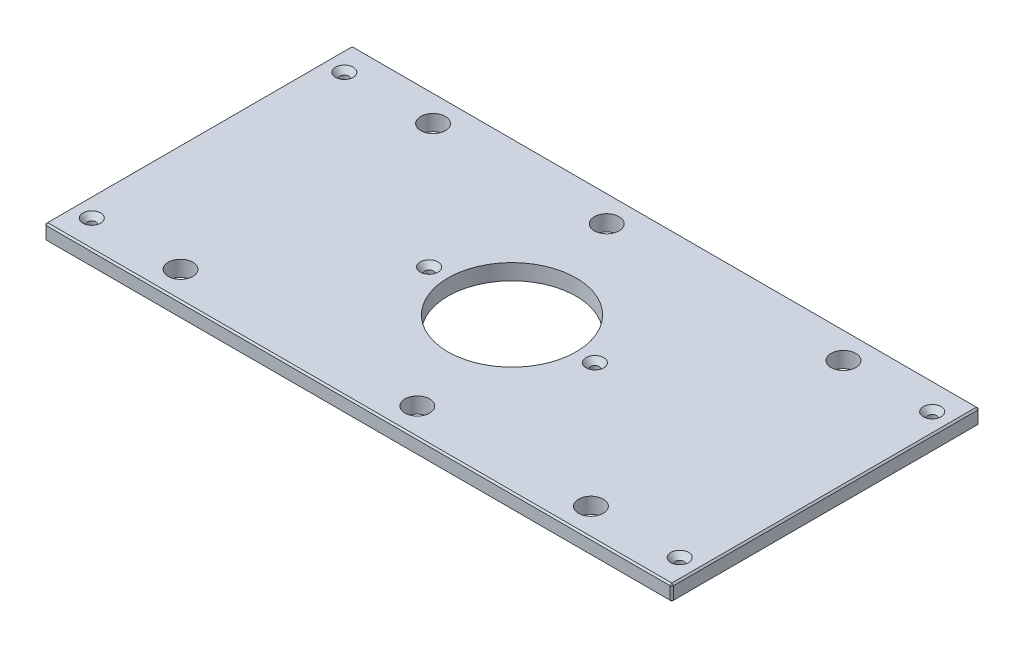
ISO-10303-21;
HEADER;
FILE_DESCRIPTION(('STEP AP214'),'2;1');
FILE_NAME('part.step','',(''),(''),'','','');
FILE_SCHEMA(('AUTOMOTIVE_DESIGN { 1 0 10303 214 1 1 1 1 }'));
ENDSEC;
DATA;
#1=APPLICATION_CONTEXT('core data for automotive mechanical design processes');
#2=APPLICATION_PROTOCOL_DEFINITION('international standard','automotive_design',2000,#1);
#3=PRODUCT_CONTEXT('',#1,'mechanical');
#4=PRODUCT('Part','Part','',(#3));
#5=PRODUCT_RELATED_PRODUCT_CATEGORY('part','',(#4));
#6=PRODUCT_DEFINITION_FORMATION('','',#4);
#7=PRODUCT_DEFINITION_CONTEXT('part definition',#1,'design');
#8=PRODUCT_DEFINITION('design','',#6,#7);
#9=PRODUCT_DEFINITION_SHAPE('','',#8);
#10=(LENGTH_UNIT() NAMED_UNIT(*) SI_UNIT(.MILLI.,.METRE.));
#11=(NAMED_UNIT(*) PLANE_ANGLE_UNIT() SI_UNIT($,.RADIAN.));
#12=(NAMED_UNIT(*) SI_UNIT($,.STERADIAN.) SOLID_ANGLE_UNIT());
#13=UNCERTAINTY_MEASURE_WITH_UNIT(LENGTH_MEASURE(1.E-05),#10,'distance_accuracy_value','');
#14=(GEOMETRIC_REPRESENTATION_CONTEXT(3) GLOBAL_UNCERTAINTY_ASSIGNED_CONTEXT((#13)) GLOBAL_UNIT_ASSIGNED_CONTEXT((#10,
#11,#12)) REPRESENTATION_CONTEXT('',''));
#15=CARTESIAN_POINT('',(0.,0.,0.));
#16=DIRECTION('',(0.,0.,1.));
#17=DIRECTION('',(1.,0.,0.));
#18=AXIS2_PLACEMENT_3D('',#15,#16,#17);
#19=CARTESIAN_POINT('',(-252.4125,12.7,-123.825));
#20=DIRECTION('',(1.,0.,0.));
#21=DIRECTION('',(0.,0.,-1.));
#22=AXIS2_PLACEMENT_3D('',#19,#20,#21);
#23=PLANE('',#22);
#24=DIRECTION('',(0.,0.,-1.));
#25=VECTOR('',#24,1.);
#26=CARTESIAN_POINT('',(-252.4125,11.4300000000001,-123.825));
#27=LINE('',#26,#25);
#28=CARTESIAN_POINT('',(-252.4125,11.4300000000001,122.555));
#29=VERTEX_POINT('',#28);
#30=CARTESIAN_POINT('',(-252.4125,11.4300000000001,-122.555));
#31=VERTEX_POINT('',#30);
#32=EDGE_CURVE('E137',#29,#31,#27,.T.);
#33=ORIENTED_EDGE('',*,*,#32,.T.);
#34=DIRECTION('',(0.,-1.,0.));
#35=VECTOR('',#34,1.);
#36=CARTESIAN_POINT('',(-252.4125,12.7,-122.555));
#37=LINE('',#36,#35);
#38=CARTESIAN_POINT('',(-252.4125,1.26999999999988,-122.555));
#39=VERTEX_POINT('',#38);
#40=EDGE_CURVE('E133',#31,#39,#37,.T.);
#41=ORIENTED_EDGE('',*,*,#40,.T.);
#42=DIRECTION('',(0.,0.,1.));
#43=VECTOR('',#42,1.);
#44=CARTESIAN_POINT('',(-252.4125,1.26999999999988,-123.825));
#45=LINE('',#44,#43);
#46=CARTESIAN_POINT('',(-252.4125,1.26999999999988,122.555));
#47=VERTEX_POINT('',#46);
#48=EDGE_CURVE('E128',#39,#47,#45,.T.);
#49=ORIENTED_EDGE('',*,*,#48,.T.);
#50=DIRECTION('',(0.,1.,0.));
#51=VECTOR('',#50,1.);
#52=CARTESIAN_POINT('',(-252.4125,12.7,122.555));
#53=LINE('',#52,#51);
#54=EDGE_CURVE('E130',#47,#29,#53,.T.);
#55=ORIENTED_EDGE('',*,*,#54,.T.);
#56=EDGE_LOOP('',(#33,#41,#49,#55));
#57=FACE_BOUND('',#56,.T.);
#58=ADVANCED_FACE('F37',(#57),#23,.F.);
#59=CARTESIAN_POINT('',(-252.4125,12.7,123.825));
#60=DIRECTION('',(0.,0.,-1.));
#61=DIRECTION('',(-1.,0.,0.));
#62=AXIS2_PLACEMENT_3D('',#59,#60,#61);
#63=PLANE('',#62);
#64=DIRECTION('',(1.,0.,0.));
#65=VECTOR('',#64,1.);
#66=CARTESIAN_POINT('',(-252.4125,1.26999999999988,123.825));
#67=LINE('',#66,#65);
#68=CARTESIAN_POINT('',(-251.1425,1.26999999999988,123.825));
#69=VERTEX_POINT('',#68);
#70=CARTESIAN_POINT('',(251.1425,1.26999999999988,123.825));
#71=VERTEX_POINT('',#70);
#72=EDGE_CURVE('E60',#69,#71,#67,.T.);
#73=ORIENTED_EDGE('',*,*,#72,.T.);
#74=DIRECTION('',(0.,1.,0.));
#75=VECTOR('',#74,1.);
#76=CARTESIAN_POINT('',(251.1425,12.7,123.825));
#77=LINE('',#76,#75);
#78=CARTESIAN_POINT('',(251.1425,11.4300000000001,123.825));
#79=VERTEX_POINT('',#78);
#80=EDGE_CURVE('E11',#71,#79,#77,.T.);
#81=ORIENTED_EDGE('',*,*,#80,.T.);
#82=DIRECTION('',(-1.,0.,0.));
#83=VECTOR('',#82,1.);
#84=CARTESIAN_POINT('',(-252.4125,11.4300000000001,123.825));
#85=LINE('',#84,#83);
#86=CARTESIAN_POINT('',(-251.1425,11.4300000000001,123.825));
#87=VERTEX_POINT('',#86);
#88=EDGE_CURVE('E46',#79,#87,#85,.T.);
#89=ORIENTED_EDGE('',*,*,#88,.T.);
#90=DIRECTION('',(0.,-1.,0.));
#91=VECTOR('',#90,1.);
#92=CARTESIAN_POINT('',(-251.1425,12.7,123.825));
#93=LINE('',#92,#91);
#94=EDGE_CURVE('E293',#87,#69,#93,.T.);
#95=ORIENTED_EDGE('',*,*,#94,.T.);
#96=EDGE_LOOP('',(#73,#81,#89,#95));
#97=FACE_BOUND('',#96,.T.);
#98=ADVANCED_FACE('F362',(#97),#63,.F.);
#99=CARTESIAN_POINT('',(252.4125,12.7,-123.825));
#100=DIRECTION('',(-1.,0.,0.));
#101=DIRECTION('',(0.,0.,1.));
#102=AXIS2_PLACEMENT_3D('',#99,#100,#101);
#103=PLANE('',#102);
#104=DIRECTION('',(0.,0.,-1.));
#105=VECTOR('',#104,1.);
#106=CARTESIAN_POINT('',(252.4125,1.26999999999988,-123.825));
#107=LINE('',#106,#105);
#108=CARTESIAN_POINT('',(252.4125,1.26999999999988,122.555));
#109=VERTEX_POINT('',#108);
#110=CARTESIAN_POINT('',(252.4125,1.26999999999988,-122.555));
#111=VERTEX_POINT('',#110);
#112=EDGE_CURVE('E288',#109,#111,#107,.T.);
#113=ORIENTED_EDGE('',*,*,#112,.T.);
#114=DIRECTION('',(0.,1.,0.));
#115=VECTOR('',#114,1.);
#116=CARTESIAN_POINT('',(252.4125,12.7,-122.555));
#117=LINE('',#116,#115);
#118=CARTESIAN_POINT('',(252.4125,11.4300000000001,-122.555));
#119=VERTEX_POINT('',#118);
#120=EDGE_CURVE('E290',#111,#119,#117,.T.);
#121=ORIENTED_EDGE('',*,*,#120,.T.);
#122=DIRECTION('',(0.,0.,1.));
#123=VECTOR('',#122,1.);
#124=CARTESIAN_POINT('',(252.4125,11.4300000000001,123.825));
#125=LINE('',#124,#123);
#126=CARTESIAN_POINT('',(252.4125,11.4300000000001,122.555));
#127=VERTEX_POINT('',#126);
#128=EDGE_CURVE('E286',#119,#127,#125,.T.);
#129=ORIENTED_EDGE('',*,*,#128,.T.);
#130=DIRECTION('',(0.,-1.,0.));
#131=VECTOR('',#130,1.);
#132=CARTESIAN_POINT('',(252.4125,12.7,122.555));
#133=LINE('',#132,#131);
#134=EDGE_CURVE('E284',#127,#109,#133,.T.);
#135=ORIENTED_EDGE('',*,*,#134,.T.);
#136=EDGE_LOOP('',(#113,#121,#129,#135));
#137=FACE_BOUND('',#136,.T.);
#138=ADVANCED_FACE('F349',(#137),#103,.F.);
#139=CARTESIAN_POINT('',(-252.4125,12.7,-123.825));
#140=DIRECTION('',(0.,0.,1.));
#141=DIRECTION('',(1.,0.,0.));
#142=AXIS2_PLACEMENT_3D('',#139,#140,#141);
#143=PLANE('',#142);
#144=DIRECTION('',(-1.,0.,0.));
#145=VECTOR('',#144,1.);
#146=CARTESIAN_POINT('',(-252.4125,1.26999999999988,-123.825));
#147=LINE('',#146,#145);
#148=CARTESIAN_POINT('',(251.1425,1.26999999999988,-123.825));
#149=VERTEX_POINT('',#148);
#150=CARTESIAN_POINT('',(-251.1425,1.26999999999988,-123.825));
#151=VERTEX_POINT('',#150);
#152=EDGE_CURVE('E260',#149,#151,#147,.T.);
#153=ORIENTED_EDGE('',*,*,#152,.T.);
#154=DIRECTION('',(0.,1.,0.));
#155=VECTOR('',#154,1.);
#156=CARTESIAN_POINT('',(-251.1425,12.7,-123.825));
#157=LINE('',#156,#155);
#158=CARTESIAN_POINT('',(-251.1425,11.4300000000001,-123.825));
#159=VERTEX_POINT('',#158);
#160=EDGE_CURVE('E264',#151,#159,#157,.T.);
#161=ORIENTED_EDGE('',*,*,#160,.T.);
#162=DIRECTION('',(1.,0.,0.));
#163=VECTOR('',#162,1.);
#164=CARTESIAN_POINT('',(252.4125,11.4300000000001,-123.825));
#165=LINE('',#164,#163);
#166=CARTESIAN_POINT('',(251.1425,11.4300000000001,-123.825));
#167=VERTEX_POINT('',#166);
#168=EDGE_CURVE('E262',#159,#167,#165,.T.);
#169=ORIENTED_EDGE('',*,*,#168,.T.);
#170=DIRECTION('',(0.,-1.,0.));
#171=VECTOR('',#170,1.);
#172=CARTESIAN_POINT('',(251.1425,12.7,-123.825));
#173=LINE('',#172,#171);
#174=EDGE_CURVE('E258',#167,#149,#173,.T.);
#175=ORIENTED_EDGE('',*,*,#174,.T.);
#176=EDGE_LOOP('',(#153,#161,#169,#175));
#177=FACE_BOUND('',#176,.T.);
#178=ADVANCED_FACE('F323',(#177),#143,.F.);
#179=CARTESIAN_POINT('',(0.,12.7,0.));
#180=DIRECTION('',(0.,1.,0.));
#181=DIRECTION('',(0.,0.,1.));
#182=AXIS2_PLACEMENT_3D('',#179,#180,#181);
#183=PLANE('',#182);
#184=CARTESIAN_POINT('',(236.5375,12.7,-101.6));
#185=DIRECTION('',(0.,1.,0.));
#186=DIRECTION('',(0.,0.,1.));
#187=AXIS2_PLACEMENT_3D('',#184,#185,#186);
#188=CIRCLE('',#187,7.13739999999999);
#189=CARTESIAN_POINT('',(236.5375,12.7,-94.4626));
#190=VERTEX_POINT('',#189);
#191=EDGE_CURVE('E786',#190,#190,#188,.T.);
#192=ORIENTED_EDGE('',*,*,#191,.F.);
#193=EDGE_LOOP('',(#192));
#194=FACE_BOUND('',#193,.T.);
#195=CARTESIAN_POINT('',(236.5375,12.7,101.6));
#196=DIRECTION('',(0.,1.,0.));
#197=DIRECTION('',(0.,0.,1.));
#198=AXIS2_PLACEMENT_3D('',#195,#196,#197);
#199=CIRCLE('',#198,7.13739999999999);
#200=CARTESIAN_POINT('',(236.5375,12.7,108.7374));
#201=VERTEX_POINT('',#200);
#202=EDGE_CURVE('E790',#201,#201,#199,.T.);
#203=ORIENTED_EDGE('',*,*,#202,.F.);
#204=EDGE_LOOP('',(#203));
#205=FACE_BOUND('',#204,.T.);
#206=CARTESIAN_POINT('',(-236.5375,12.7,101.6));
#207=DIRECTION('',(0.,1.,0.));
#208=DIRECTION('',(0.,0.,1.));
#209=AXIS2_PLACEMENT_3D('',#206,#207,#208);
#210=CIRCLE('',#209,7.13739999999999);
#211=CARTESIAN_POINT('',(-236.5375,12.7,108.7374));
#212=VERTEX_POINT('',#211);
#213=EDGE_CURVE('E794',#212,#212,#210,.T.);
#214=ORIENTED_EDGE('',*,*,#213,.F.);
#215=EDGE_LOOP('',(#214));
#216=FACE_BOUND('',#215,.T.);
#217=CARTESIAN_POINT('',(-66.675,12.7,0.));
#218=DIRECTION('',(0.,1.,0.));
#219=DIRECTION('',(0.,0.,1.));
#220=AXIS2_PLACEMENT_3D('',#217,#218,#219);
#221=CIRCLE('',#220,7.1374);
#222=CARTESIAN_POINT('',(-66.675,12.7,7.1374));
#223=VERTEX_POINT('',#222);
#224=EDGE_CURVE('E798',#223,#223,#221,.T.);
#225=ORIENTED_EDGE('',*,*,#224,.F.);
#226=EDGE_LOOP('',(#225));
#227=FACE_BOUND('',#226,.T.);
#228=CARTESIAN_POINT('',(66.675,12.7,0.));
#229=DIRECTION('',(0.,1.,0.));
#230=DIRECTION('',(0.,0.,1.));
#231=AXIS2_PLACEMENT_3D('',#228,#229,#230);
#232=CIRCLE('',#231,7.1374);
#233=CARTESIAN_POINT('',(66.675,12.7,7.1374));
#234=VERTEX_POINT('',#233);
#235=EDGE_CURVE('E802',#234,#234,#232,.T.);
#236=ORIENTED_EDGE('',*,*,#235,.F.);
#237=EDGE_LOOP('',(#236));
#238=FACE_BOUND('',#237,.T.);
#239=CARTESIAN_POINT('',(-236.5375,12.7,-101.6));
#240=DIRECTION('',(0.,1.,0.));
#241=DIRECTION('',(0.,0.,1.));
#242=AXIS2_PLACEMENT_3D('',#239,#240,#241);
#243=CIRCLE('',#242,7.13739999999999);
#244=CARTESIAN_POINT('',(-236.5375,12.7,-94.4626));
#245=VERTEX_POINT('',#244);
#246=EDGE_CURVE('E805',#245,#245,#243,.T.);
#247=ORIENTED_EDGE('',*,*,#246,.F.);
#248=EDGE_LOOP('',(#247));
#249=FACE_BOUND('',#248,.T.);
#250=DIRECTION('',(0.,0.,-1.));
#251=VECTOR('',#250,1.);
#252=CARTESIAN_POINT('',(251.1425,12.7,-123.825));
#253=LINE('',#252,#251);
#254=CARTESIAN_POINT('',(251.1425,12.7,122.555));
#255=VERTEX_POINT('',#254);
#256=CARTESIAN_POINT('',(251.1425,12.7,-122.555));
#257=VERTEX_POINT('',#256);
#258=EDGE_CURVE('E271',#255,#257,#253,.T.);
#259=ORIENTED_EDGE('',*,*,#258,.T.);
#260=DIRECTION('',(-1.,0.,0.));
#261=VECTOR('',#260,1.);
#262=CARTESIAN_POINT('',(-252.4125,12.7,-122.555));
#263=LINE('',#262,#261);
#264=CARTESIAN_POINT('',(-251.1425,12.7,-122.555));
#265=VERTEX_POINT('',#264);
#266=EDGE_CURVE('E273',#257,#265,#263,.T.);
#267=ORIENTED_EDGE('',*,*,#266,.T.);
#268=DIRECTION('',(0.,0.,1.));
#269=VECTOR('',#268,1.);
#270=CARTESIAN_POINT('',(-251.1425,12.7,123.825));
#271=LINE('',#270,#269);
#272=CARTESIAN_POINT('',(-251.1425,12.7,122.555));
#273=VERTEX_POINT('',#272);
#274=EDGE_CURVE('E269',#265,#273,#271,.T.);
#275=ORIENTED_EDGE('',*,*,#274,.T.);
#276=DIRECTION('',(1.,0.,0.));
#277=VECTOR('',#276,1.);
#278=CARTESIAN_POINT('',(252.4125,12.7,122.555));
#279=LINE('',#278,#277);
#280=EDGE_CURVE('E267',#273,#255,#279,.T.);
#281=ORIENTED_EDGE('',*,*,#280,.T.);
#282=EDGE_LOOP('',(#259,#267,#275,#281));
#283=FACE_BOUND('',#282,.T.);
#284=CARTESIAN_POINT('',(165.1,12.7,-101.6));
#285=DIRECTION('',(0.,1.,0.));
#286=DIRECTION('',(0.,0.,1.));
#287=AXIS2_PLACEMENT_3D('',#284,#285,#286);
#288=CIRCLE('',#287,9.921875);
#289=CARTESIAN_POINT('',(165.1,12.7,-91.678125));
#290=VERTEX_POINT('',#289);
#291=EDGE_CURVE('E206',#290,#290,#288,.T.);
#292=ORIENTED_EDGE('',*,*,#291,.F.);
#293=EDGE_LOOP('',(#292));
#294=FACE_BOUND('',#293,.T.);
#295=CARTESIAN_POINT('',(-165.1,12.7,-101.6));
#296=DIRECTION('',(0.,1.,0.));
#297=DIRECTION('',(0.,0.,1.));
#298=AXIS2_PLACEMENT_3D('',#295,#296,#297);
#299=CIRCLE('',#298,9.921875);
#300=CARTESIAN_POINT('',(-165.1,12.7,-91.678125));
#301=VERTEX_POINT('',#300);
#302=EDGE_CURVE('E216',#301,#301,#299,.T.);
#303=ORIENTED_EDGE('',*,*,#302,.F.);
#304=EDGE_LOOP('',(#303));
#305=FACE_BOUND('',#304,.T.);
#306=CARTESIAN_POINT('',(165.1,12.7,101.6));
#307=DIRECTION('',(0.,1.,0.));
#308=DIRECTION('',(0.,0.,1.));
#309=AXIS2_PLACEMENT_3D('',#306,#307,#308);
#310=CIRCLE('',#309,9.921875);
#311=CARTESIAN_POINT('',(165.1,12.7,111.521875));
#312=VERTEX_POINT('',#311);
#313=EDGE_CURVE('E227',#312,#312,#310,.T.);
#314=ORIENTED_EDGE('',*,*,#313,.F.);
#315=EDGE_LOOP('',(#314));
#316=FACE_BOUND('',#315,.T.);
#317=CARTESIAN_POINT('',(-165.1,12.7,101.6));
#318=DIRECTION('',(0.,1.,0.));
#319=DIRECTION('',(0.,0.,1.));
#320=AXIS2_PLACEMENT_3D('',#317,#318,#319);
#321=CIRCLE('',#320,9.921875);
#322=CARTESIAN_POINT('',(-165.1,12.7,111.521875));
#323=VERTEX_POINT('',#322);
#324=EDGE_CURVE('E233',#323,#323,#321,.T.);
#325=ORIENTED_EDGE('',*,*,#324,.F.);
#326=EDGE_LOOP('',(#325));
#327=FACE_BOUND('',#326,.T.);
#328=CARTESIAN_POINT('',(-25.4,12.7,-101.6));
#329=DIRECTION('',(0.,1.,0.));
#330=DIRECTION('',(0.,0.,1.));
#331=AXIS2_PLACEMENT_3D('',#328,#329,#330);
#332=CIRCLE('',#331,9.921875);
#333=CARTESIAN_POINT('',(-25.4,12.7,-91.678125));
#334=VERTEX_POINT('',#333);
#335=EDGE_CURVE('E239',#334,#334,#332,.T.);
#336=ORIENTED_EDGE('',*,*,#335,.F.);
#337=EDGE_LOOP('',(#336));
#338=FACE_BOUND('',#337,.T.);
#339=CARTESIAN_POINT('',(25.4,12.7,101.6));
#340=DIRECTION('',(0.,1.,0.));
#341=DIRECTION('',(0.,0.,1.));
#342=AXIS2_PLACEMENT_3D('',#339,#340,#341);
#343=CIRCLE('',#342,9.921875);
#344=CARTESIAN_POINT('',(25.4,12.7,111.521875));
#345=VERTEX_POINT('',#344);
#346=EDGE_CURVE('E245',#345,#345,#343,.T.);
#347=ORIENTED_EDGE('',*,*,#346,.F.);
#348=EDGE_LOOP('',(#347));
#349=FACE_BOUND('',#348,.T.);
#350=CARTESIAN_POINT('',(0.,12.7,0.));
#351=DIRECTION('',(0.,1.,0.));
#352=DIRECTION('',(0.,0.,1.));
#353=AXIS2_PLACEMENT_3D('',#350,#351,#352);
#354=CIRCLE('',#353,51.562);
#355=CARTESIAN_POINT('',(0.,12.7,51.562));
#356=VERTEX_POINT('',#355);
#357=EDGE_CURVE('E251',#356,#356,#354,.T.);
#358=ORIENTED_EDGE('',*,*,#357,.F.);
#359=EDGE_LOOP('',(#358));
#360=FACE_BOUND('',#359,.T.);
#361=ADVANCED_FACE('F371',(#194,#205,#216,#227,#238,#249,#283,#294,#305,#316,#327,#338,#349,
#360),#183,.T.);
#362=CARTESIAN_POINT('',(0.,0.,0.));
#363=DIRECTION('',(0.,1.,0.));
#364=DIRECTION('',(0.,0.,1.));
#365=AXIS2_PLACEMENT_3D('',#362,#363,#364);
#366=PLANE('',#365);
#367=CARTESIAN_POINT('',(236.5375,0.,-101.6));
#368=DIRECTION('',(0.,1.,0.));
#369=DIRECTION('',(0.,0.,1.));
#370=AXIS2_PLACEMENT_3D('',#367,#368,#369);
#371=CIRCLE('',#370,3.3782);
#372=CARTESIAN_POINT('',(236.5375,0.,-98.2218));
#373=VERTEX_POINT('',#372);
#374=EDGE_CURVE('E839',#373,#373,#371,.T.);
#375=ORIENTED_EDGE('',*,*,#374,.T.);
#376=EDGE_LOOP('',(#375));
#377=FACE_BOUND('',#376,.T.);
#378=CARTESIAN_POINT('',(236.5375,0.,101.6));
#379=DIRECTION('',(0.,1.,0.));
#380=DIRECTION('',(0.,0.,1.));
#381=AXIS2_PLACEMENT_3D('',#378,#379,#380);
#382=CIRCLE('',#381,3.3782);
#383=CARTESIAN_POINT('',(236.5375,0.,104.9782));
#384=VERTEX_POINT('',#383);
#385=EDGE_CURVE('E832',#384,#384,#382,.T.);
#386=ORIENTED_EDGE('',*,*,#385,.T.);
#387=EDGE_LOOP('',(#386));
#388=FACE_BOUND('',#387,.T.);
#389=CARTESIAN_POINT('',(-236.5375,0.,101.6));
#390=DIRECTION('',(0.,1.,0.));
#391=DIRECTION('',(0.,0.,1.));
#392=AXIS2_PLACEMENT_3D('',#389,#390,#391);
#393=CIRCLE('',#392,3.3782);
#394=CARTESIAN_POINT('',(-236.5375,0.,104.9782));
#395=VERTEX_POINT('',#394);
#396=EDGE_CURVE('E825',#395,#395,#393,.T.);
#397=ORIENTED_EDGE('',*,*,#396,.T.);
#398=EDGE_LOOP('',(#397));
#399=FACE_BOUND('',#398,.T.);
#400=CARTESIAN_POINT('',(-66.675,0.,0.));
#401=DIRECTION('',(0.,1.,0.));
#402=DIRECTION('',(0.,0.,1.));
#403=AXIS2_PLACEMENT_3D('',#400,#401,#402);
#404=CIRCLE('',#403,3.3782);
#405=CARTESIAN_POINT('',(-66.675,0.,3.3782));
#406=VERTEX_POINT('',#405);
#407=EDGE_CURVE('E818',#406,#406,#404,.T.);
#408=ORIENTED_EDGE('',*,*,#407,.T.);
#409=EDGE_LOOP('',(#408));
#410=FACE_BOUND('',#409,.T.);
#411=CARTESIAN_POINT('',(66.675,0.,0.));
#412=DIRECTION('',(0.,1.,0.));
#413=DIRECTION('',(0.,0.,1.));
#414=AXIS2_PLACEMENT_3D('',#411,#412,#413);
#415=CIRCLE('',#414,3.3782);
#416=CARTESIAN_POINT('',(66.675,0.,3.3782));
#417=VERTEX_POINT('',#416);
#418=EDGE_CURVE('E808',#417,#417,#415,.T.);
#419=ORIENTED_EDGE('',*,*,#418,.T.);
#420=EDGE_LOOP('',(#419));
#421=FACE_BOUND('',#420,.T.);
#422=CARTESIAN_POINT('',(-236.5375,0.,-101.6));
#423=DIRECTION('',(0.,1.,0.));
#424=DIRECTION('',(0.,0.,1.));
#425=AXIS2_PLACEMENT_3D('',#422,#423,#424);
#426=CIRCLE('',#425,3.3782);
#427=CARTESIAN_POINT('',(-236.5375,0.,-98.2218));
#428=VERTEX_POINT('',#427);
#429=EDGE_CURVE('E219',#428,#428,#426,.T.);
#430=ORIENTED_EDGE('',*,*,#429,.T.);
#431=EDGE_LOOP('',(#430));
#432=FACE_BOUND('',#431,.T.);
#433=DIRECTION('',(0.,0.,-1.));
#434=VECTOR('',#433,1.);
#435=CARTESIAN_POINT('',(-251.1425,0.,0.));
#436=LINE('',#435,#434);
#437=CARTESIAN_POINT('',(-251.1425,0.,122.555));
#438=VERTEX_POINT('',#437);
#439=CARTESIAN_POINT('',(-251.1425,0.,-122.555));
#440=VERTEX_POINT('',#439);
#441=EDGE_CURVE('E160',#438,#440,#436,.T.);
#442=ORIENTED_EDGE('',*,*,#441,.T.);
#443=DIRECTION('',(1.,0.,0.));
#444=VECTOR('',#443,1.);
#445=CARTESIAN_POINT('',(0.,0.,-122.555));
#446=LINE('',#445,#444);
#447=CARTESIAN_POINT('',(251.1425,0.,-122.555));
#448=VERTEX_POINT('',#447);
#449=EDGE_CURVE('E281',#440,#448,#446,.T.);
#450=ORIENTED_EDGE('',*,*,#449,.T.);
#451=DIRECTION('',(0.,0.,1.));
#452=VECTOR('',#451,1.);
#453=CARTESIAN_POINT('',(251.1425,0.,0.));
#454=LINE('',#453,#452);
#455=CARTESIAN_POINT('',(251.1425,0.,122.555));
#456=VERTEX_POINT('',#455);
#457=EDGE_CURVE('E279',#448,#456,#454,.T.);
#458=ORIENTED_EDGE('',*,*,#457,.T.);
#459=DIRECTION('',(-1.,0.,0.));
#460=VECTOR('',#459,1.);
#461=CARTESIAN_POINT('',(0.,0.,122.555));
#462=LINE('',#461,#460);
#463=EDGE_CURVE('E276',#456,#438,#462,.T.);
#464=ORIENTED_EDGE('',*,*,#463,.T.);
#465=EDGE_LOOP('',(#442,#450,#458,#464));
#466=FACE_BOUND('',#465,.T.);
#467=CARTESIAN_POINT('',(165.1,0.,-101.6));
#468=DIRECTION('',(0.,1.,0.));
#469=DIRECTION('',(0.,0.,1.));
#470=AXIS2_PLACEMENT_3D('',#467,#468,#469);
#471=CIRCLE('',#470,9.921875);
#472=CARTESIAN_POINT('',(165.1,0.,-91.678125));
#473=VERTEX_POINT('',#472);
#474=EDGE_CURVE('E211',#473,#473,#471,.T.);
#475=ORIENTED_EDGE('',*,*,#474,.T.);
#476=EDGE_LOOP('',(#475));
#477=FACE_BOUND('',#476,.T.);
#478=CARTESIAN_POINT('',(-165.1,0.,-101.6));
#479=DIRECTION('',(0.,1.,0.));
#480=DIRECTION('',(0.,0.,1.));
#481=AXIS2_PLACEMENT_3D('',#478,#479,#480);
#482=CIRCLE('',#481,9.921875);
#483=CARTESIAN_POINT('',(-165.1,0.,-91.678125));
#484=VERTEX_POINT('',#483);
#485=EDGE_CURVE('E224',#484,#484,#482,.T.);
#486=ORIENTED_EDGE('',*,*,#485,.T.);
#487=EDGE_LOOP('',(#486));
#488=FACE_BOUND('',#487,.T.);
#489=CARTESIAN_POINT('',(165.1,0.,101.6));
#490=DIRECTION('',(0.,1.,0.));
#491=DIRECTION('',(0.,0.,1.));
#492=AXIS2_PLACEMENT_3D('',#489,#490,#491);
#493=CIRCLE('',#492,9.921875);
#494=CARTESIAN_POINT('',(165.1,0.,111.521875));
#495=VERTEX_POINT('',#494);
#496=EDGE_CURVE('E230',#495,#495,#493,.T.);
#497=ORIENTED_EDGE('',*,*,#496,.T.);
#498=EDGE_LOOP('',(#497));
#499=FACE_BOUND('',#498,.T.);
#500=CARTESIAN_POINT('',(-165.1,0.,101.6));
#501=DIRECTION('',(0.,1.,0.));
#502=DIRECTION('',(0.,0.,1.));
#503=AXIS2_PLACEMENT_3D('',#500,#501,#502);
#504=CIRCLE('',#503,9.921875);
#505=CARTESIAN_POINT('',(-165.1,0.,111.521875));
#506=VERTEX_POINT('',#505);
#507=EDGE_CURVE('E236',#506,#506,#504,.T.);
#508=ORIENTED_EDGE('',*,*,#507,.T.);
#509=EDGE_LOOP('',(#508));
#510=FACE_BOUND('',#509,.T.);
#511=CARTESIAN_POINT('',(-25.4,0.,-101.6));
#512=DIRECTION('',(0.,1.,0.));
#513=DIRECTION('',(0.,0.,1.));
#514=AXIS2_PLACEMENT_3D('',#511,#512,#513);
#515=CIRCLE('',#514,9.921875);
#516=CARTESIAN_POINT('',(-25.4,0.,-91.678125));
#517=VERTEX_POINT('',#516);
#518=EDGE_CURVE('E242',#517,#517,#515,.T.);
#519=ORIENTED_EDGE('',*,*,#518,.T.);
#520=EDGE_LOOP('',(#519));
#521=FACE_BOUND('',#520,.T.);
#522=CARTESIAN_POINT('',(25.4,0.,101.6));
#523=DIRECTION('',(0.,1.,0.));
#524=DIRECTION('',(0.,0.,1.));
#525=AXIS2_PLACEMENT_3D('',#522,#523,#524);
#526=CIRCLE('',#525,9.921875);
#527=CARTESIAN_POINT('',(25.4,0.,111.521875));
#528=VERTEX_POINT('',#527);
#529=EDGE_CURVE('E248',#528,#528,#526,.T.);
#530=ORIENTED_EDGE('',*,*,#529,.T.);
#531=EDGE_LOOP('',(#530));
#532=FACE_BOUND('',#531,.T.);
#533=CARTESIAN_POINT('',(0.,0.,0.));
#534=DIRECTION('',(0.,1.,0.));
#535=DIRECTION('',(0.,0.,1.));
#536=AXIS2_PLACEMENT_3D('',#533,#534,#535);
#537=CIRCLE('',#536,51.562);
#538=CARTESIAN_POINT('',(0.,0.,51.562));
#539=VERTEX_POINT('',#538);
#540=EDGE_CURVE('E149',#539,#539,#537,.T.);
#541=ORIENTED_EDGE('',*,*,#540,.T.);
#542=EDGE_LOOP('',(#541));
#543=FACE_BOUND('',#542,.T.);
#544=ADVANCED_FACE('F336',(#377,#388,#399,#410,#421,#432,#466,#477,#488,#499,#510,#521,#532,
#543),#366,.F.);
#545=CARTESIAN_POINT('',(0.,0.,0.));
#546=DIRECTION('',(0.,1.,0.));
#547=DIRECTION('',(0.,0.,1.));
#548=AXIS2_PLACEMENT_3D('',#545,#546,#547);
#549=CYLINDRICAL_SURFACE('',#548,51.562);
#550=ORIENTED_EDGE('',*,*,#540,.F.);
#551=EDGE_LOOP('',(#550));
#552=FACE_BOUND('',#551,.T.);
#553=ORIENTED_EDGE('',*,*,#357,.T.);
#554=EDGE_LOOP('',(#553));
#555=FACE_BOUND('',#554,.T.);
#556=ADVANCED_FACE('F723',(#552,#555),#549,.F.);
#557=CARTESIAN_POINT('',(25.4,12.7,101.6));
#558=DIRECTION('',(0.,1.,0.));
#559=DIRECTION('',(0.,0.,1.));
#560=AXIS2_PLACEMENT_3D('',#557,#558,#559);
#561=CYLINDRICAL_SURFACE('',#560,9.921875);
#562=ORIENTED_EDGE('',*,*,#529,.F.);
#563=EDGE_LOOP('',(#562));
#564=FACE_BOUND('',#563,.T.);
#565=ORIENTED_EDGE('',*,*,#346,.T.);
#566=EDGE_LOOP('',(#565));
#567=FACE_BOUND('',#566,.T.);
#568=ADVANCED_FACE('F714',(#564,#567),#561,.F.);
#569=CARTESIAN_POINT('',(-25.4,12.7,-101.6));
#570=DIRECTION('',(0.,1.,0.));
#571=DIRECTION('',(0.,0.,1.));
#572=AXIS2_PLACEMENT_3D('',#569,#570,#571);
#573=CYLINDRICAL_SURFACE('',#572,9.921875);
#574=ORIENTED_EDGE('',*,*,#518,.F.);
#575=EDGE_LOOP('',(#574));
#576=FACE_BOUND('',#575,.T.);
#577=ORIENTED_EDGE('',*,*,#335,.T.);
#578=EDGE_LOOP('',(#577));
#579=FACE_BOUND('',#578,.T.);
#580=ADVANCED_FACE('F705',(#576,#579),#573,.F.);
#581=CARTESIAN_POINT('',(-165.1,12.7,101.6));
#582=DIRECTION('',(0.,1.,0.));
#583=DIRECTION('',(0.,0.,1.));
#584=AXIS2_PLACEMENT_3D('',#581,#582,#583);
#585=CYLINDRICAL_SURFACE('',#584,9.921875);
#586=ORIENTED_EDGE('',*,*,#507,.F.);
#587=EDGE_LOOP('',(#586));
#588=FACE_BOUND('',#587,.T.);
#589=ORIENTED_EDGE('',*,*,#324,.T.);
#590=EDGE_LOOP('',(#589));
#591=FACE_BOUND('',#590,.T.);
#592=ADVANCED_FACE('F696',(#588,#591),#585,.F.);
#593=CARTESIAN_POINT('',(165.1,12.7,101.6));
#594=DIRECTION('',(0.,1.,0.));
#595=DIRECTION('',(0.,0.,1.));
#596=AXIS2_PLACEMENT_3D('',#593,#594,#595);
#597=CYLINDRICAL_SURFACE('',#596,9.921875);
#598=ORIENTED_EDGE('',*,*,#496,.F.);
#599=EDGE_LOOP('',(#598));
#600=FACE_BOUND('',#599,.T.);
#601=ORIENTED_EDGE('',*,*,#313,.T.);
#602=EDGE_LOOP('',(#601));
#603=FACE_BOUND('',#602,.T.);
#604=ADVANCED_FACE('F687',(#600,#603),#597,.F.);
#605=CARTESIAN_POINT('',(-165.1,12.7,-101.6));
#606=DIRECTION('',(0.,1.,0.));
#607=DIRECTION('',(0.,0.,1.));
#608=AXIS2_PLACEMENT_3D('',#605,#606,#607);
#609=CYLINDRICAL_SURFACE('',#608,9.921875);
#610=ORIENTED_EDGE('',*,*,#485,.F.);
#611=EDGE_LOOP('',(#610));
#612=FACE_BOUND('',#611,.T.);
#613=ORIENTED_EDGE('',*,*,#302,.T.);
#614=EDGE_LOOP('',(#613));
#615=FACE_BOUND('',#614,.T.);
#616=ADVANCED_FACE('F677',(#612,#615),#609,.F.);
#617=CARTESIAN_POINT('',(165.1,12.7,-101.6));
#618=DIRECTION('',(0.,1.,0.));
#619=DIRECTION('',(0.,0.,1.));
#620=AXIS2_PLACEMENT_3D('',#617,#618,#619);
#621=CYLINDRICAL_SURFACE('',#620,9.921875);
#622=ORIENTED_EDGE('',*,*,#474,.F.);
#623=EDGE_LOOP('',(#622));
#624=FACE_BOUND('',#623,.T.);
#625=ORIENTED_EDGE('',*,*,#291,.T.);
#626=EDGE_LOOP('',(#625));
#627=FACE_BOUND('',#626,.T.);
#628=ADVANCED_FACE('F380',(#624,#627),#621,.F.);
#629=CARTESIAN_POINT('',(252.4125,12.7,122.555));
#630=DIRECTION('',(-0.707106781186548,0.,-0.707106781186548));
#631=DIRECTION('',(0.,-1.,0.));
#632=AXIS2_PLACEMENT_3D('',#629,#630,#631);
#633=PLANE('',#632);
#634=DIRECTION('',(-0.707106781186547,0.,0.707106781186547));
#635=VECTOR('',#634,1.);
#636=CARTESIAN_POINT('',(252.4125,11.4300000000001,122.555));
#637=LINE('',#636,#635);
#638=EDGE_CURVE('E41',#79,#127,#637,.F.);
#639=ORIENTED_EDGE('',*,*,#638,.F.);
#640=ORIENTED_EDGE('',*,*,#80,.F.);
#641=DIRECTION('',(0.707106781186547,0.,-0.707106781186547));
#642=VECTOR('',#641,1.);
#643=CARTESIAN_POINT('',(251.7775,1.26999999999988,123.19));
#644=LINE('',#643,#642);
#645=EDGE_CURVE('E199',#109,#71,#644,.F.);
#646=ORIENTED_EDGE('',*,*,#645,.F.);
#647=ORIENTED_EDGE('',*,*,#134,.F.);
#648=EDGE_LOOP('',(#639,#640,#646,#647));
#649=FACE_BOUND('',#648,.T.);
#650=ADVANCED_FACE('F39',(#649),#633,.F.);
#651=CARTESIAN_POINT('',(252.4125,11.4300000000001,122.555));
#652=DIRECTION('',(0.577350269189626,0.577350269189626,0.577350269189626));
#653=DIRECTION('',(0.707106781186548,0.,-0.707106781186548));
#654=AXIS2_PLACEMENT_3D('',#651,#652,#653);
#655=PLANE('',#654);
#656=DIRECTION('',(0.,-0.707106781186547,0.707106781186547));
#657=VECTOR('',#656,1.);
#658=CARTESIAN_POINT('',(251.1425,12.0650000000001,123.19));
#659=LINE('',#658,#657);
#660=EDGE_CURVE('E195',#79,#255,#659,.F.);
#661=ORIENTED_EDGE('',*,*,#660,.F.);
#662=ORIENTED_EDGE('',*,*,#638,.T.);
#663=DIRECTION('',(-0.707106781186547,0.707106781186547,0.));
#664=VECTOR('',#663,1.);
#665=CARTESIAN_POINT('',(252.4125,11.4300000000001,122.555));
#666=LINE('',#665,#664);
#667=EDGE_CURVE('E197',#255,#127,#666,.F.);
#668=ORIENTED_EDGE('',*,*,#667,.F.);
#669=EDGE_LOOP('',(#661,#662,#668));
#670=FACE_BOUND('',#669,.T.);
#671=ADVANCED_FACE('F373',(#670),#655,.T.);
#672=CARTESIAN_POINT('',(251.1425,0.,122.555));
#673=DIRECTION('',(0.577350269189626,-0.577350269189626,0.577350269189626));
#674=DIRECTION('',(0.707106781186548,0.,-0.707106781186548));
#675=AXIS2_PLACEMENT_3D('',#672,#673,#674);
#676=PLANE('',#675);
#677=DIRECTION('',(-0.707106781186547,-0.707106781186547,0.));
#678=VECTOR('',#677,1.);
#679=CARTESIAN_POINT('',(251.1425,0.,122.555));
#680=LINE('',#679,#678);
#681=EDGE_CURVE('E189',#109,#456,#680,.T.);
#682=ORIENTED_EDGE('',*,*,#681,.F.);
#683=ORIENTED_EDGE('',*,*,#645,.T.);
#684=DIRECTION('',(0.,0.707106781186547,0.707106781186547));
#685=VECTOR('',#684,1.);
#686=CARTESIAN_POINT('',(251.1425,0.,122.555));
#687=LINE('',#686,#685);
#688=EDGE_CURVE('E192',#456,#71,#687,.T.);
#689=ORIENTED_EDGE('',*,*,#688,.F.);
#690=EDGE_LOOP('',(#682,#683,#689));
#691=FACE_BOUND('',#690,.T.);
#692=ADVANCED_FACE('F342',(#691),#676,.T.);
#693=CARTESIAN_POINT('',(251.1425,12.7,0.));
#694=DIRECTION('',(0.707106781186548,0.707106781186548,0.));
#695=DIRECTION('',(0.,0.,1.));
#696=AXIS2_PLACEMENT_3D('',#693,#694,#695);
#697=PLANE('',#696);
#698=ORIENTED_EDGE('',*,*,#667,.T.);
#699=ORIENTED_EDGE('',*,*,#128,.F.);
#700=DIRECTION('',(0.707106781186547,-0.707106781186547,0.));
#701=VECTOR('',#700,1.);
#702=CARTESIAN_POINT('',(251.7775,12.0650000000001,-122.555));
#703=LINE('',#702,#701);
#704=EDGE_CURVE('E184',#257,#119,#703,.T.);
#705=ORIENTED_EDGE('',*,*,#704,.F.);
#706=ORIENTED_EDGE('',*,*,#258,.F.);
#707=EDGE_LOOP('',(#698,#699,#705,#706));
#708=FACE_BOUND('',#707,.T.);
#709=ADVANCED_FACE('F359',(#708),#697,.T.);
#710=CARTESIAN_POINT('',(0.,12.7,122.555));
#711=DIRECTION('',(0.,0.707106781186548,0.707106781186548));
#712=DIRECTION('',(-1.,0.,0.));
#713=AXIS2_PLACEMENT_3D('',#710,#711,#712);
#714=PLANE('',#713);
#715=ORIENTED_EDGE('',*,*,#660,.T.);
#716=ORIENTED_EDGE('',*,*,#280,.F.);
#717=DIRECTION('',(0.,0.707106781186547,-0.707106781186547));
#718=VECTOR('',#717,1.);
#719=CARTESIAN_POINT('',(-251.1425,12.7,122.555));
#720=LINE('',#719,#718);
#721=EDGE_CURVE('E181',#87,#273,#720,.T.);
#722=ORIENTED_EDGE('',*,*,#721,.F.);
#723=ORIENTED_EDGE('',*,*,#88,.F.);
#724=EDGE_LOOP('',(#715,#716,#722,#723));
#725=FACE_BOUND('',#724,.T.);
#726=ADVANCED_FACE('F364',(#725),#714,.T.);
#727=CARTESIAN_POINT('',(-251.1425,12.7,123.825));
#728=DIRECTION('',(0.707106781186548,0.,-0.707106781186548));
#729=DIRECTION('',(0.,-1.,0.));
#730=AXIS2_PLACEMENT_3D('',#727,#728,#729);
#731=PLANE('',#730);
#732=DIRECTION('',(0.707106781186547,0.,0.707106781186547));
#733=VECTOR('',#732,1.);
#734=CARTESIAN_POINT('',(-252.4125,1.26999999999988,122.555));
#735=LINE('',#734,#733);
#736=EDGE_CURVE('E144',#69,#47,#735,.F.);
#737=ORIENTED_EDGE('',*,*,#736,.F.);
#738=ORIENTED_EDGE('',*,*,#94,.F.);
#739=DIRECTION('',(-0.707106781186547,0.,-0.707106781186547));
#740=VECTOR('',#739,1.);
#741=CARTESIAN_POINT('',(-251.7775,11.4300000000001,123.19));
#742=LINE('',#741,#740);
#743=EDGE_CURVE('E147',#29,#87,#742,.F.);
#744=ORIENTED_EDGE('',*,*,#743,.F.);
#745=ORIENTED_EDGE('',*,*,#54,.F.);
#746=EDGE_LOOP('',(#737,#738,#744,#745));
#747=FACE_BOUND('',#746,.T.);
#748=ADVANCED_FACE('F142',(#747),#731,.F.);
#749=CARTESIAN_POINT('',(-252.4125,1.26999999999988,123.825));
#750=DIRECTION('',(0.,0.707106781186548,-0.707106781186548));
#751=DIRECTION('',(1.,0.,0.));
#752=AXIS2_PLACEMENT_3D('',#749,#750,#751);
#753=PLANE('',#752);
#754=ORIENTED_EDGE('',*,*,#688,.T.);
#755=ORIENTED_EDGE('',*,*,#72,.F.);
#756=DIRECTION('',(0.,-0.707106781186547,-0.707106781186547));
#757=VECTOR('',#756,1.);
#758=CARTESIAN_POINT('',(-251.1425,0.634999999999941,123.19));
#759=LINE('',#758,#757);
#760=EDGE_CURVE('E157',#438,#69,#759,.F.);
#761=ORIENTED_EDGE('',*,*,#760,.F.);
#762=ORIENTED_EDGE('',*,*,#463,.F.);
#763=EDGE_LOOP('',(#754,#755,#761,#762));
#764=FACE_BOUND('',#763,.T.);
#765=ADVANCED_FACE('F341',(#764),#753,.F.);
#766=CARTESIAN_POINT('',(252.4125,1.26999999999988,-123.825));
#767=DIRECTION('',(-0.707106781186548,0.707106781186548,0.));
#768=DIRECTION('',(0.,0.,-1.));
#769=AXIS2_PLACEMENT_3D('',#766,#767,#768);
#770=PLANE('',#769);
#771=ORIENTED_EDGE('',*,*,#681,.T.);
#772=ORIENTED_EDGE('',*,*,#457,.F.);
#773=DIRECTION('',(0.707106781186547,0.707106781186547,0.));
#774=VECTOR('',#773,1.);
#775=CARTESIAN_POINT('',(251.1425,0.,-122.555));
#776=LINE('',#775,#774);
#777=EDGE_CURVE('E176',#111,#448,#776,.F.);
#778=ORIENTED_EDGE('',*,*,#777,.F.);
#779=ORIENTED_EDGE('',*,*,#112,.F.);
#780=EDGE_LOOP('',(#771,#772,#778,#779));
#781=FACE_BOUND('',#780,.T.);
#782=ADVANCED_FACE('F346',(#781),#770,.F.);
#783=CARTESIAN_POINT('',(251.1425,12.7,-123.825));
#784=DIRECTION('',(-0.707106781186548,0.,0.707106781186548));
#785=DIRECTION('',(0.,-1.,0.));
#786=AXIS2_PLACEMENT_3D('',#783,#784,#785);
#787=PLANE('',#786);
#788=DIRECTION('',(0.707106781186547,0.,0.707106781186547));
#789=VECTOR('',#788,1.);
#790=CARTESIAN_POINT('',(251.1425,11.4300000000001,-123.825));
#791=LINE('',#790,#789);
#792=EDGE_CURVE('E186',#119,#167,#791,.F.);
#793=ORIENTED_EDGE('',*,*,#792,.F.);
#794=ORIENTED_EDGE('',*,*,#120,.F.);
#795=DIRECTION('',(-0.707106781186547,0.,-0.707106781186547));
#796=VECTOR('',#795,1.);
#797=CARTESIAN_POINT('',(251.7775,1.26999999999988,-123.19));
#798=LINE('',#797,#796);
#799=EDGE_CURVE('E173',#149,#111,#798,.F.);
#800=ORIENTED_EDGE('',*,*,#799,.F.);
#801=ORIENTED_EDGE('',*,*,#174,.F.);
#802=EDGE_LOOP('',(#793,#794,#800,#801));
#803=FACE_BOUND('',#802,.T.);
#804=ADVANCED_FACE('F354',(#803),#787,.F.);
#805=CARTESIAN_POINT('',(251.1425,11.4300000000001,-123.825));
#806=DIRECTION('',(0.577350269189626,0.577350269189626,-0.577350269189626));
#807=DIRECTION('',(-0.707106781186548,0.,-0.707106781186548));
#808=AXIS2_PLACEMENT_3D('',#805,#806,#807);
#809=PLANE('',#808);
#810=ORIENTED_EDGE('',*,*,#704,.T.);
#811=ORIENTED_EDGE('',*,*,#792,.T.);
#812=DIRECTION('',(0.,0.707106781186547,0.707106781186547));
#813=VECTOR('',#812,1.);
#814=CARTESIAN_POINT('',(251.1425,11.4300000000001,-123.825));
#815=LINE('',#814,#813);
#816=EDGE_CURVE('E165',#257,#167,#815,.F.);
#817=ORIENTED_EDGE('',*,*,#816,.F.);
#818=EDGE_LOOP('',(#810,#811,#817));
#819=FACE_BOUND('',#818,.T.);
#820=ADVANCED_FACE('F412',(#819),#809,.T.);
#821=CARTESIAN_POINT('',(-251.1425,12.7,122.555));
#822=DIRECTION('',(-0.577350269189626,0.577350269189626,0.577350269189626));
#823=DIRECTION('',(0.707106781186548,0.,0.707106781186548));
#824=AXIS2_PLACEMENT_3D('',#821,#822,#823);
#825=PLANE('',#824);
#826=ORIENTED_EDGE('',*,*,#743,.T.);
#827=ORIENTED_EDGE('',*,*,#721,.T.);
#828=DIRECTION('',(-0.707106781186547,-0.707106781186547,0.));
#829=VECTOR('',#828,1.);
#830=CARTESIAN_POINT('',(-251.1425,12.7,122.555));
#831=LINE('',#830,#829);
#832=EDGE_CURVE('E161',#29,#273,#831,.F.);
#833=ORIENTED_EDGE('',*,*,#832,.F.);
#834=EDGE_LOOP('',(#826,#827,#833));
#835=FACE_BOUND('',#834,.T.);
#836=ADVANCED_FACE('F366',(#835),#825,.T.);
#837=CARTESIAN_POINT('',(-252.4125,1.26999999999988,122.555));
#838=DIRECTION('',(-0.577350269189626,-0.577350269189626,0.577350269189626));
#839=DIRECTION('',(0.707106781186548,0.,0.707106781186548));
#840=AXIS2_PLACEMENT_3D('',#837,#838,#839);
#841=PLANE('',#840);
#842=ORIENTED_EDGE('',*,*,#760,.T.);
#843=ORIENTED_EDGE('',*,*,#736,.T.);
#844=DIRECTION('',(-0.707106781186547,0.707106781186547,0.));
#845=VECTOR('',#844,1.);
#846=CARTESIAN_POINT('',(-252.4125,1.26999999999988,122.555));
#847=LINE('',#846,#845);
#848=EDGE_CURVE('E154',#438,#47,#847,.T.);
#849=ORIENTED_EDGE('',*,*,#848,.F.);
#850=EDGE_LOOP('',(#842,#843,#849));
#851=FACE_BOUND('',#850,.T.);
#852=ADVANCED_FACE('F153',(#851),#841,.T.);
#853=CARTESIAN_POINT('',(251.1425,0.,-122.555));
#854=DIRECTION('',(0.577350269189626,-0.577350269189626,-0.577350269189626));
#855=DIRECTION('',(-0.707106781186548,0.,-0.707106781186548));
#856=AXIS2_PLACEMENT_3D('',#853,#854,#855);
#857=PLANE('',#856);
#858=ORIENTED_EDGE('',*,*,#799,.T.);
#859=ORIENTED_EDGE('',*,*,#777,.T.);
#860=DIRECTION('',(0.,-0.707106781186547,0.707106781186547));
#861=VECTOR('',#860,1.);
#862=CARTESIAN_POINT('',(251.1425,0.,-122.555));
#863=LINE('',#862,#861);
#864=EDGE_CURVE('E162',#149,#448,#863,.T.);
#865=ORIENTED_EDGE('',*,*,#864,.F.);
#866=EDGE_LOOP('',(#858,#859,#865));
#867=FACE_BOUND('',#866,.T.);
#868=ADVANCED_FACE('F404',(#867),#857,.T.);
#869=CARTESIAN_POINT('',(0.,12.7,-122.555));
#870=DIRECTION('',(0.,0.707106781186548,-0.707106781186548));
#871=DIRECTION('',(1.,0.,0.));
#872=AXIS2_PLACEMENT_3D('',#869,#870,#871);
#873=PLANE('',#872);
#874=ORIENTED_EDGE('',*,*,#816,.T.);
#875=ORIENTED_EDGE('',*,*,#168,.F.);
#876=DIRECTION('',(0.,-0.707106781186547,-0.707106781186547));
#877=VECTOR('',#876,1.);
#878=CARTESIAN_POINT('',(-251.1425,11.4300000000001,-123.825));
#879=LINE('',#878,#877);
#880=EDGE_CURVE('E167',#265,#159,#879,.T.);
#881=ORIENTED_EDGE('',*,*,#880,.F.);
#882=ORIENTED_EDGE('',*,*,#266,.F.);
#883=EDGE_LOOP('',(#874,#875,#881,#882));
#884=FACE_BOUND('',#883,.T.);
#885=ADVANCED_FACE('F318',(#884),#873,.T.);
#886=CARTESIAN_POINT('',(-251.1425,12.7,0.));
#887=DIRECTION('',(-0.707106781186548,0.707106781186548,0.));
#888=DIRECTION('',(0.,0.,-1.));
#889=AXIS2_PLACEMENT_3D('',#886,#887,#888);
#890=PLANE('',#889);
#891=ORIENTED_EDGE('',*,*,#832,.T.);
#892=ORIENTED_EDGE('',*,*,#274,.F.);
#893=DIRECTION('',(0.707106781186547,0.707106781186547,0.));
#894=VECTOR('',#893,1.);
#895=CARTESIAN_POINT('',(-251.7775,12.0650000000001,-122.555));
#896=LINE('',#895,#894);
#897=EDGE_CURVE('E307',#31,#265,#896,.T.);
#898=ORIENTED_EDGE('',*,*,#897,.F.);
#899=ORIENTED_EDGE('',*,*,#32,.F.);
#900=EDGE_LOOP('',(#891,#892,#898,#899));
#901=FACE_BOUND('',#900,.T.);
#902=ADVANCED_FACE('F369',(#901),#890,.T.);
#903=CARTESIAN_POINT('',(-252.4125,1.26999999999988,-123.825));
#904=DIRECTION('',(0.707106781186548,0.707106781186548,0.));
#905=DIRECTION('',(0.,0.,1.));
#906=AXIS2_PLACEMENT_3D('',#903,#904,#905);
#907=PLANE('',#906);
#908=ORIENTED_EDGE('',*,*,#848,.T.);
#909=ORIENTED_EDGE('',*,*,#48,.F.);
#910=DIRECTION('',(0.707106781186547,-0.707106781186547,0.));
#911=VECTOR('',#910,1.);
#912=CARTESIAN_POINT('',(-252.4125,1.26999999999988,-122.555));
#913=LINE('',#912,#911);
#914=EDGE_CURVE('E304',#440,#39,#913,.F.);
#915=ORIENTED_EDGE('',*,*,#914,.F.);
#916=ORIENTED_EDGE('',*,*,#441,.F.);
#917=EDGE_LOOP('',(#908,#909,#915,#916));
#918=FACE_BOUND('',#917,.T.);
#919=ADVANCED_FACE('F159',(#918),#907,.F.);
#920=CARTESIAN_POINT('',(-252.4125,1.26999999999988,-123.825));
#921=DIRECTION('',(0.,0.707106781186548,0.707106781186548));
#922=DIRECTION('',(-1.,0.,0.));
#923=AXIS2_PLACEMENT_3D('',#920,#921,#922);
#924=PLANE('',#923);
#925=ORIENTED_EDGE('',*,*,#864,.T.);
#926=ORIENTED_EDGE('',*,*,#449,.F.);
#927=DIRECTION('',(0.,0.707106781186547,-0.707106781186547));
#928=VECTOR('',#927,1.);
#929=CARTESIAN_POINT('',(-251.1425,0.634999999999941,-123.19));
#930=LINE('',#929,#928);
#931=EDGE_CURVE('E301',#151,#440,#930,.F.);
#932=ORIENTED_EDGE('',*,*,#931,.F.);
#933=ORIENTED_EDGE('',*,*,#152,.F.);
#934=EDGE_LOOP('',(#925,#926,#932,#933));
#935=FACE_BOUND('',#934,.T.);
#936=ADVANCED_FACE('F333',(#935),#924,.F.);
#937=CARTESIAN_POINT('',(-251.1425,11.4300000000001,-123.825));
#938=DIRECTION('',(-0.577350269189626,0.577350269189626,-0.577350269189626));
#939=DIRECTION('',(-0.707106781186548,0.,0.707106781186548));
#940=AXIS2_PLACEMENT_3D('',#937,#938,#939);
#941=PLANE('',#940);
#942=ORIENTED_EDGE('',*,*,#897,.T.);
#943=ORIENTED_EDGE('',*,*,#880,.T.);
#944=DIRECTION('',(0.707106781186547,0.,-0.707106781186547));
#945=VECTOR('',#944,1.);
#946=CARTESIAN_POINT('',(-251.1425,11.4300000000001,-123.825));
#947=LINE('',#946,#945);
#948=EDGE_CURVE('E299',#31,#159,#947,.T.);
#949=ORIENTED_EDGE('',*,*,#948,.F.);
#950=EDGE_LOOP('',(#942,#943,#949));
#951=FACE_BOUND('',#950,.T.);
#952=ADVANCED_FACE('F313',(#951),#941,.T.);
#953=CARTESIAN_POINT('',(-252.4125,1.26999999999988,-122.555));
#954=DIRECTION('',(-0.577350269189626,-0.577350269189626,-0.577350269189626));
#955=DIRECTION('',(-0.707106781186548,0.,0.707106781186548));
#956=AXIS2_PLACEMENT_3D('',#953,#954,#955);
#957=PLANE('',#956);
#958=ORIENTED_EDGE('',*,*,#931,.T.);
#959=ORIENTED_EDGE('',*,*,#914,.T.);
#960=DIRECTION('',(-0.707106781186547,0.,0.707106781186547));
#961=VECTOR('',#960,1.);
#962=CARTESIAN_POINT('',(-252.4125,1.26999999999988,-122.555));
#963=LINE('',#962,#961);
#964=EDGE_CURVE('E297',#151,#39,#963,.T.);
#965=ORIENTED_EDGE('',*,*,#964,.F.);
#966=EDGE_LOOP('',(#958,#959,#965));
#967=FACE_BOUND('',#966,.T.);
#968=ADVANCED_FACE('F330',(#967),#957,.T.);
#969=CARTESIAN_POINT('',(-252.4125,12.7,-122.555));
#970=DIRECTION('',(0.707106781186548,0.,0.707106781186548));
#971=DIRECTION('',(0.,-1.,0.));
#972=AXIS2_PLACEMENT_3D('',#969,#970,#971);
#973=PLANE('',#972);
#974=ORIENTED_EDGE('',*,*,#948,.T.);
#975=ORIENTED_EDGE('',*,*,#160,.F.);
#976=ORIENTED_EDGE('',*,*,#964,.T.);
#977=ORIENTED_EDGE('',*,*,#40,.F.);
#978=EDGE_LOOP('',(#974,#975,#976,#977));
#979=FACE_BOUND('',#978,.T.);
#980=ADVANCED_FACE('F328',(#979),#973,.F.);
#981=CARTESIAN_POINT('',(-236.5375,12.7,-101.6));
#982=DIRECTION('',(0.,1.,0.));
#983=DIRECTION('',(0.,0.,1.));
#984=AXIS2_PLACEMENT_3D('',#981,#982,#983);
#985=CYLINDRICAL_SURFACE('',#984,3.3782);
#986=ORIENTED_EDGE('',*,*,#429,.F.);
#987=EDGE_LOOP('',(#986));
#988=FACE_BOUND('',#987,.T.);
#989=CARTESIAN_POINT('',(-236.5375,8.37553508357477,-101.6));
#990=DIRECTION('',(0.,1.,0.));
#991=DIRECTION('',(0.,0.,1.));
#992=AXIS2_PLACEMENT_3D('',#989,#990,#991);
#993=CIRCLE('',#992,3.3782);
#994=CARTESIAN_POINT('',(-236.5375,8.37553508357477,-98.2218));
#995=VERTEX_POINT('',#994);
#996=EDGE_CURVE('E807',#995,#995,#993,.T.);
#997=ORIENTED_EDGE('',*,*,#996,.T.);
#998=EDGE_LOOP('',(#997));
#999=FACE_BOUND('',#998,.T.);
#1000=ADVANCED_FACE('F391',(#988,#999),#985,.F.);
#1001=CARTESIAN_POINT('',(-236.5375,12.7,-101.6));
#1002=DIRECTION('',(0.,1.,0.));
#1003=DIRECTION('',(0.,0.,1.));
#1004=AXIS2_PLACEMENT_3D('',#1001,#1002,#1003);
#1005=CONICAL_SURFACE('',#1004,7.13739999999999,0.715584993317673);
#1006=ORIENTED_EDGE('',*,*,#996,.F.);
#1007=EDGE_LOOP('',(#1006));
#1008=FACE_BOUND('',#1007,.T.);
#1009=ORIENTED_EDGE('',*,*,#246,.T.);
#1010=EDGE_LOOP('',(#1009));
#1011=FACE_BOUND('',#1010,.T.);
#1012=ADVANCED_FACE('F501',(#1008,#1011),#1005,.F.);
#1013=CARTESIAN_POINT('',(66.675,12.7,0.));
#1014=DIRECTION('',(0.,1.,0.));
#1015=DIRECTION('',(0.,0.,1.));
#1016=AXIS2_PLACEMENT_3D('',#1013,#1014,#1015);
#1017=CYLINDRICAL_SURFACE('',#1016,3.3782);
#1018=ORIENTED_EDGE('',*,*,#418,.F.);
#1019=EDGE_LOOP('',(#1018));
#1020=FACE_BOUND('',#1019,.T.);
#1021=CARTESIAN_POINT('',(66.675,8.37553508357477,0.));
#1022=DIRECTION('',(0.,1.,0.));
#1023=DIRECTION('',(0.,0.,1.));
#1024=AXIS2_PLACEMENT_3D('',#1021,#1022,#1023);
#1025=CIRCLE('',#1024,3.3782);
#1026=CARTESIAN_POINT('',(66.675,8.37553508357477,3.3782));
#1027=VERTEX_POINT('',#1026);
#1028=EDGE_CURVE('E812',#1027,#1027,#1025,.T.);
#1029=ORIENTED_EDGE('',*,*,#1028,.T.);
#1030=EDGE_LOOP('',(#1029));
#1031=FACE_BOUND('',#1030,.T.);
#1032=ADVANCED_FACE('F510',(#1020,#1031),#1017,.F.);
#1033=CARTESIAN_POINT('',(66.675,12.7,0.));
#1034=DIRECTION('',(0.,1.,0.));
#1035=DIRECTION('',(0.,0.,1.));
#1036=AXIS2_PLACEMENT_3D('',#1033,#1034,#1035);
#1037=CONICAL_SURFACE('',#1036,7.1374,0.715584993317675);
#1038=ORIENTED_EDGE('',*,*,#1028,.F.);
#1039=EDGE_LOOP('',(#1038));
#1040=FACE_BOUND('',#1039,.T.);
#1041=ORIENTED_EDGE('',*,*,#235,.T.);
#1042=EDGE_LOOP('',(#1041));
#1043=FACE_BOUND('',#1042,.T.);
#1044=ADVANCED_FACE('F518',(#1040,#1043),#1037,.F.);
#1045=CARTESIAN_POINT('',(-66.675,12.7,0.));
#1046=DIRECTION('',(0.,1.,0.));
#1047=DIRECTION('',(0.,0.,1.));
#1048=AXIS2_PLACEMENT_3D('',#1045,#1046,#1047);
#1049=CYLINDRICAL_SURFACE('',#1048,3.3782);
#1050=ORIENTED_EDGE('',*,*,#407,.F.);
#1051=EDGE_LOOP('',(#1050));
#1052=FACE_BOUND('',#1051,.T.);
#1053=CARTESIAN_POINT('',(-66.675,8.37553508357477,0.));
#1054=DIRECTION('',(0.,1.,0.));
#1055=DIRECTION('',(0.,0.,1.));
#1056=AXIS2_PLACEMENT_3D('',#1053,#1054,#1055);
#1057=CIRCLE('',#1056,3.3782);
#1058=CARTESIAN_POINT('',(-66.675,8.37553508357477,3.3782));
#1059=VERTEX_POINT('',#1058);
#1060=EDGE_CURVE('E821',#1059,#1059,#1057,.T.);
#1061=ORIENTED_EDGE('',*,*,#1060,.T.);
#1062=EDGE_LOOP('',(#1061));
#1063=FACE_BOUND('',#1062,.T.);
#1064=ADVANCED_FACE('F526',(#1052,#1063),#1049,.F.);
#1065=CARTESIAN_POINT('',(-66.675,12.7,0.));
#1066=DIRECTION('',(0.,1.,0.));
#1067=DIRECTION('',(0.,0.,1.));
#1068=AXIS2_PLACEMENT_3D('',#1065,#1066,#1067);
#1069=CONICAL_SURFACE('',#1068,7.1374,0.715584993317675);
#1070=ORIENTED_EDGE('',*,*,#1060,.F.);
#1071=EDGE_LOOP('',(#1070));
#1072=FACE_BOUND('',#1071,.T.);
#1073=ORIENTED_EDGE('',*,*,#224,.T.);
#1074=EDGE_LOOP('',(#1073));
#1075=FACE_BOUND('',#1074,.T.);
#1076=ADVANCED_FACE('F534',(#1072,#1075),#1069,.F.);
#1077=CARTESIAN_POINT('',(-236.5375,12.7,101.6));
#1078=DIRECTION('',(0.,1.,0.));
#1079=DIRECTION('',(0.,0.,1.));
#1080=AXIS2_PLACEMENT_3D('',#1077,#1078,#1079);
#1081=CYLINDRICAL_SURFACE('',#1080,3.3782);
#1082=ORIENTED_EDGE('',*,*,#396,.F.);
#1083=EDGE_LOOP('',(#1082));
#1084=FACE_BOUND('',#1083,.T.);
#1085=CARTESIAN_POINT('',(-236.5375,8.37553508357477,101.6));
#1086=DIRECTION('',(0.,1.,0.));
#1087=DIRECTION('',(0.,0.,1.));
#1088=AXIS2_PLACEMENT_3D('',#1085,#1086,#1087);
#1089=CIRCLE('',#1088,3.3782);
#1090=CARTESIAN_POINT('',(-236.5375,8.37553508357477,104.9782));
#1091=VERTEX_POINT('',#1090);
#1092=EDGE_CURVE('E828',#1091,#1091,#1089,.T.);
#1093=ORIENTED_EDGE('',*,*,#1092,.T.);
#1094=EDGE_LOOP('',(#1093));
#1095=FACE_BOUND('',#1094,.T.);
#1096=ADVANCED_FACE('F542',(#1084,#1095),#1081,.F.);
#1097=CARTESIAN_POINT('',(-236.5375,12.7,101.6));
#1098=DIRECTION('',(0.,1.,0.));
#1099=DIRECTION('',(0.,0.,1.));
#1100=AXIS2_PLACEMENT_3D('',#1097,#1098,#1099);
#1101=CONICAL_SURFACE('',#1100,7.13739999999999,0.715584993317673);
#1102=ORIENTED_EDGE('',*,*,#1092,.F.);
#1103=EDGE_LOOP('',(#1102));
#1104=FACE_BOUND('',#1103,.T.);
#1105=ORIENTED_EDGE('',*,*,#213,.T.);
#1106=EDGE_LOOP('',(#1105));
#1107=FACE_BOUND('',#1106,.T.);
#1108=ADVANCED_FACE('F550',(#1104,#1107),#1101,.F.);
#1109=CARTESIAN_POINT('',(236.5375,12.7,101.6));
#1110=DIRECTION('',(0.,1.,0.));
#1111=DIRECTION('',(0.,0.,1.));
#1112=AXIS2_PLACEMENT_3D('',#1109,#1110,#1111);
#1113=CYLINDRICAL_SURFACE('',#1112,3.3782);
#1114=ORIENTED_EDGE('',*,*,#385,.F.);
#1115=EDGE_LOOP('',(#1114));
#1116=FACE_BOUND('',#1115,.T.);
#1117=CARTESIAN_POINT('',(236.5375,8.37553508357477,101.6));
#1118=DIRECTION('',(0.,1.,0.));
#1119=DIRECTION('',(0.,0.,1.));
#1120=AXIS2_PLACEMENT_3D('',#1117,#1118,#1119);
#1121=CIRCLE('',#1120,3.3782);
#1122=CARTESIAN_POINT('',(236.5375,8.37553508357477,104.9782));
#1123=VERTEX_POINT('',#1122);
#1124=EDGE_CURVE('E835',#1123,#1123,#1121,.T.);
#1125=ORIENTED_EDGE('',*,*,#1124,.T.);
#1126=EDGE_LOOP('',(#1125));
#1127=FACE_BOUND('',#1126,.T.);
#1128=ADVANCED_FACE('F558',(#1116,#1127),#1113,.F.);
#1129=CARTESIAN_POINT('',(236.5375,12.7,101.6));
#1130=DIRECTION('',(0.,1.,0.));
#1131=DIRECTION('',(0.,0.,1.));
#1132=AXIS2_PLACEMENT_3D('',#1129,#1130,#1131);
#1133=CONICAL_SURFACE('',#1132,7.13739999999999,0.715584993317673);
#1134=ORIENTED_EDGE('',*,*,#1124,.F.);
#1135=EDGE_LOOP('',(#1134));
#1136=FACE_BOUND('',#1135,.T.);
#1137=ORIENTED_EDGE('',*,*,#202,.T.);
#1138=EDGE_LOOP('',(#1137));
#1139=FACE_BOUND('',#1138,.T.);
#1140=ADVANCED_FACE('F566',(#1136,#1139),#1133,.F.);
#1141=CARTESIAN_POINT('',(236.5375,12.7,-101.6));
#1142=DIRECTION('',(0.,1.,0.));
#1143=DIRECTION('',(0.,0.,1.));
#1144=AXIS2_PLACEMENT_3D('',#1141,#1142,#1143);
#1145=CYLINDRICAL_SURFACE('',#1144,3.3782);
#1146=ORIENTED_EDGE('',*,*,#374,.F.);
#1147=EDGE_LOOP('',(#1146));
#1148=FACE_BOUND('',#1147,.T.);
#1149=CARTESIAN_POINT('',(236.5375,8.37553508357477,-101.6));
#1150=DIRECTION('',(0.,1.,0.));
#1151=DIRECTION('',(0.,0.,1.));
#1152=AXIS2_PLACEMENT_3D('',#1149,#1150,#1151);
#1153=CIRCLE('',#1152,3.3782);
#1154=CARTESIAN_POINT('',(236.5375,8.37553508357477,-98.2218));
#1155=VERTEX_POINT('',#1154);
#1156=EDGE_CURVE('E842',#1155,#1155,#1153,.T.);
#1157=ORIENTED_EDGE('',*,*,#1156,.T.);
#1158=EDGE_LOOP('',(#1157));
#1159=FACE_BOUND('',#1158,.T.);
#1160=ADVANCED_FACE('F574',(#1148,#1159),#1145,.F.);
#1161=CARTESIAN_POINT('',(236.5375,12.7,-101.6));
#1162=DIRECTION('',(0.,1.,0.));
#1163=DIRECTION('',(0.,0.,1.));
#1164=AXIS2_PLACEMENT_3D('',#1161,#1162,#1163);
#1165=CONICAL_SURFACE('',#1164,7.13739999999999,0.715584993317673);
#1166=ORIENTED_EDGE('',*,*,#1156,.F.);
#1167=EDGE_LOOP('',(#1166));
#1168=FACE_BOUND('',#1167,.T.);
#1169=ORIENTED_EDGE('',*,*,#191,.T.);
#1170=EDGE_LOOP('',(#1169));
#1171=FACE_BOUND('',#1170,.T.);
#1172=ADVANCED_FACE('F582',(#1168,#1171),#1165,.F.);
#1173=CLOSED_SHELL('',(#58,#98,#138,#178,#361,#544,#556,#568,#580,#592,#604,#616,#628,#650,#671,
#692,#709,#726,#748,#765,#782,#804,#820,#836,#852,#868,#885,#902,#919,#936,#952,#968,#980,#1000,
#1012,#1032,#1044,#1064,#1076,#1096,#1108,#1128,#1140,#1160,#1172));
#1174=MANIFOLD_SOLID_BREP('B2',#1173);
#1175=ADVANCED_BREP_SHAPE_REPRESENTATION('',(#18,#1174),#14);
#1176=SHAPE_DEFINITION_REPRESENTATION(#9,#1175);
ENDSEC;
END-ISO-10303-21;
